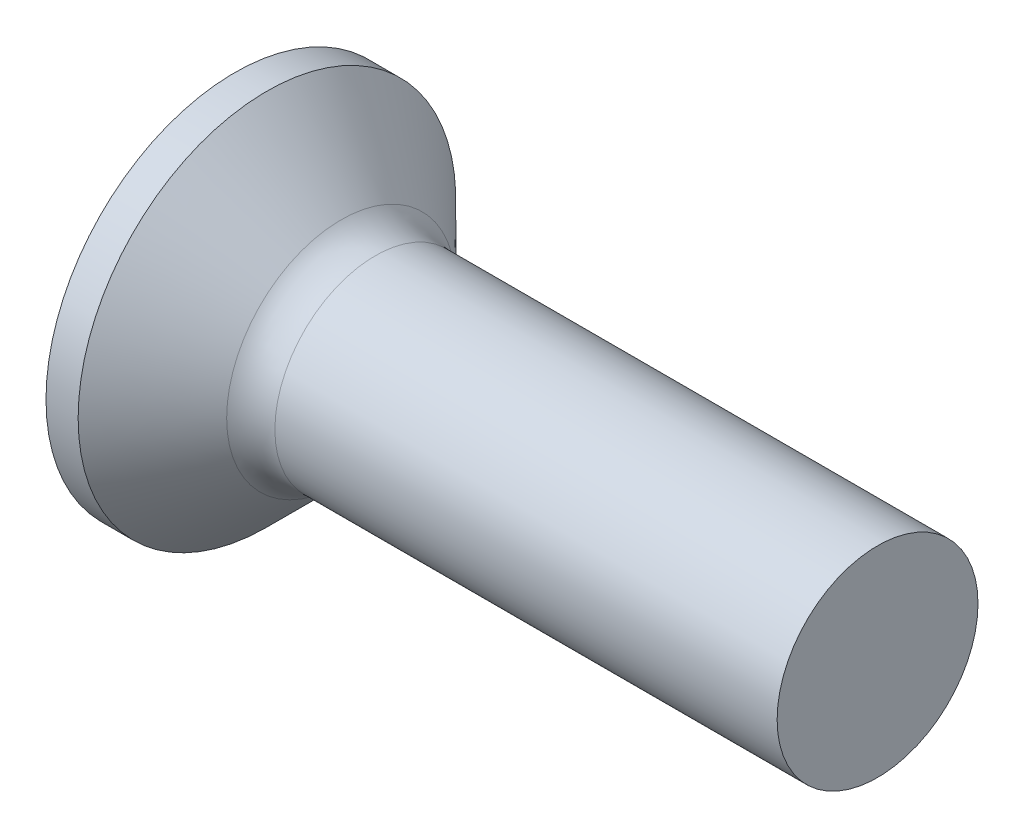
from build123d import *

# Parameters (mm, degrees)
FILLET1_R    = 0.6
RECPAT_COUNT = 2
RECPAT_ANGLE = 90


with BuildPart() as part:
    # BodySke → Base-Revolve (revolve)
    with BuildSketch(Plane.XY, mode=Mode.PRIVATE) as base_revolve_sk:
        Polygon((0, 0), (0, 2.35), (0.4, 2.35), (1.5, 1.25), (8, 1.25), (8, 0), align=None)
    revolve(base_revolve_sk.sketch.rotate(Axis((-6.35, 0, 0), (1, 0, 0)), 90), axis=Axis((-6.35, 0, 0), (1, 0, 0)))

    # Fillet1
    fillet1_edges = [part.edges().sort_by_distance(p)[0] for p in [
        (1.5, 0, -1.25),
    ]]
    fillet(fillet1_edges, radius=FILLET1_R)

    # Sketch3 → Recess section 0
    with BuildSketch(Plane.ZY):
        with BuildLine():
            Line((-0.37, 1.4), (0.37, 1.4))
            Line((0.37, 1.4), (0.37, -1.4))
            Line((0.37, -1.4), (-0.37, -1.4))
            Line((-0.37, -1.4), (-0.37, 1.4))
        make_face()
    # Sketch4 → Recess section 1
    with BuildSketch(Plane.ZY.offset(-1.73)):
        with BuildLine():
            Line((-0.37, 0.537453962), (0.37, 0.537453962))
            Line((0.37, 0.537453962), (0.37, -0.537453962))
            Line((0.37, -0.537453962), (-0.37, -0.537453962))
            Line((-0.37, -0.537453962), (-0.37, 0.537453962))
        make_face()
    recess = loft(mode=Mode.SUBTRACT)

    # RecPat: Recess ×2 about axis
    recpat_axis = Axis((0, 0, 0), (1, 0, 0))
    for i in range(1, RECPAT_COUNT):
        add(recess.rotate(recpat_axis, i * RECPAT_ANGLE / (RECPAT_COUNT - 1)), mode=Mode.SUBTRACT)

    # RecCorSke → RecessCore (revolve, cut)
    with BuildSketch(Plane.XY, mode=Mode.PRIVATE) as recesscore_sk:
        Polygon((0, 0), (0, 0.676973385), (1.73, 0.556), (1.910655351, 0), align=None)
    revolve(recesscore_sk.sketch.rotate(Axis((-3.175, 0, 0), (1, 0, 0)), 90), axis=Axis((-3.175, 0, 0), (1, 0, 0)), mode=Mode.SUBTRACT)


solid = part.part
